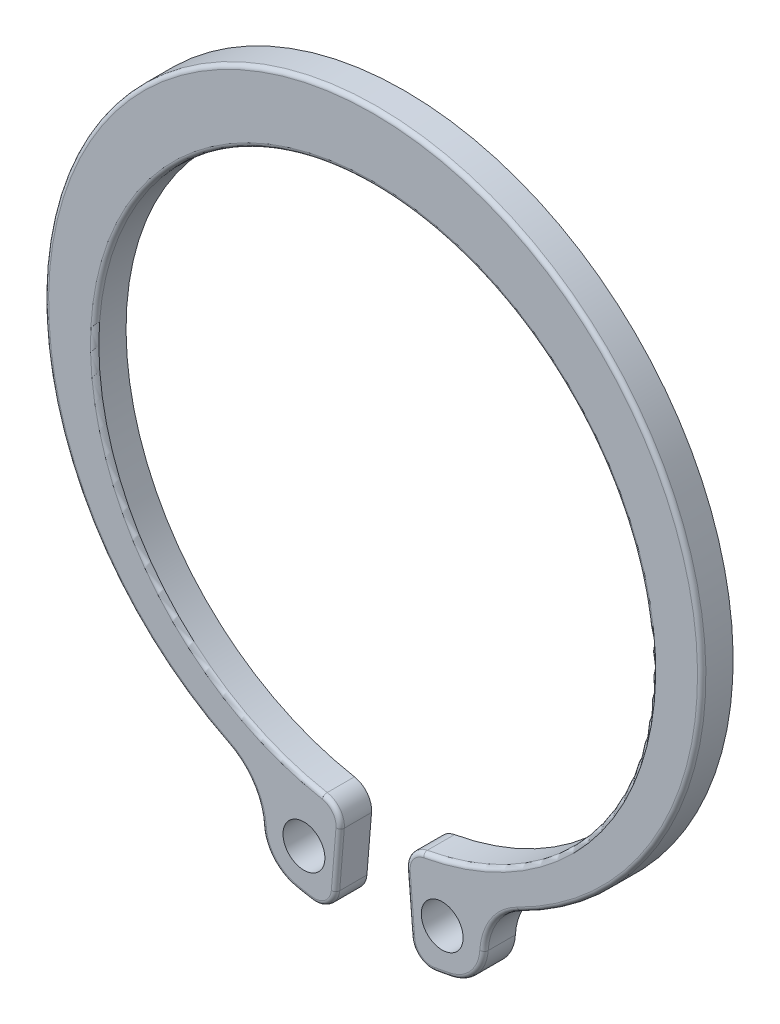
from build123d import *

# Parameters (mm, degrees)
ESQUISSE1_R          = 1
BASE_EXTRUSION_DEPTH = 1.5
CONG_1_R             = 1
CONG_2_R             = 0.2


with BuildPart() as part:
    # Esquisse1 → Base-Extrusion (new body)
    with BuildSketch(Plane.XY):
        with BuildLine():
            Line((1.496445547, -13.215545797), (1.880760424, -17.8998069))
            ThreePointArc((1.880760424, -17.8998069), (2.801433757, -17.778985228), (3.714650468, -17.610840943))
            ThreePointArc((3.714650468, -17.610840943), (4.815766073, -16.960854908), (5.298101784, -15.77667178))
            ThreePointArc((5.298101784, -15.77667178), (5.793613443, -14.300754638), (6.962105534, -13.271925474))
            ThreePointArc((6.962105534, -13.271925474), (0, 16.5), (-6.962105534, -13.271925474))
            ThreePointArc((-6.962105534, -13.271925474), (-5.793613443, -14.300754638), (-5.298101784, -15.77667178))
            ThreePointArc((-5.298101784, -15.77667178), (-4.815766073, -16.960854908), (-3.714650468, -17.610840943))
            ThreePointArc((-3.714650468, -17.610840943), (-2.801433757, -17.778985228), (-1.880760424, -17.8998069))
            Line((-1.880760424, -17.8998069), (-1.496445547, -13.215545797))
            ThreePointArc((-1.496445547, -13.215545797), (0, 13.3), (1.496445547, -13.215545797))
        make_face()
        with Locations((3.301873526, -15.653900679)):
            Circle(ESQUISSE1_R, mode=Mode.SUBTRACT)
        with Locations(Location((-3.301873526, -15.653900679, 0), (0, 0, 180))):
            Circle(ESQUISSE1_R, mode=Mode.SUBTRACT)
    extrude(amount=BASE_EXTRUSION_DEPTH)

    # Cong_1
    cong_1_edges = [part.edges().sort_by_distance(p)[0] for p in [
        (-1.496445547, -13.215545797, 0.75),
        (-1.880760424, -17.8998069, 0.75),
        (1.880760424, -17.8998069, 0.75),
        (1.496445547, -13.215545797, 0.75),
    ]]
    fillet(cong_1_edges, radius=CONG_1_R)

    # Cong_2
    cong_2_edges = [part.edges().sort_by_distance(p)[0] for p in [
        (4.815766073, -16.960854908, 1.5),
        (5.793613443, -14.300754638, 1.5),
        (0, 16.5, 1.5),
        (-5.793613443, -14.300754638, 1.5),
        (-4.815766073, -16.960854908, 1.5),
        (-3.335811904, -17.686511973, 1.5),
        (3.335811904, -17.686511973, 1.5),
        (1.683804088, -15.499184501, 1.5),
        (0, 13.3, 1.5),
        (-1.683804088, -15.499184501, 1.5),
        (-1.77610165, -13.458754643, 1.5),
        (1.77610165, -13.458754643, 1.5),
        (-2.17654164, -17.556378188, 1.5),
        (2.17654164, -17.556378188, 1.5),
    ]]
    fillet(cong_2_edges, radius=CONG_2_R)


solid = part.part
